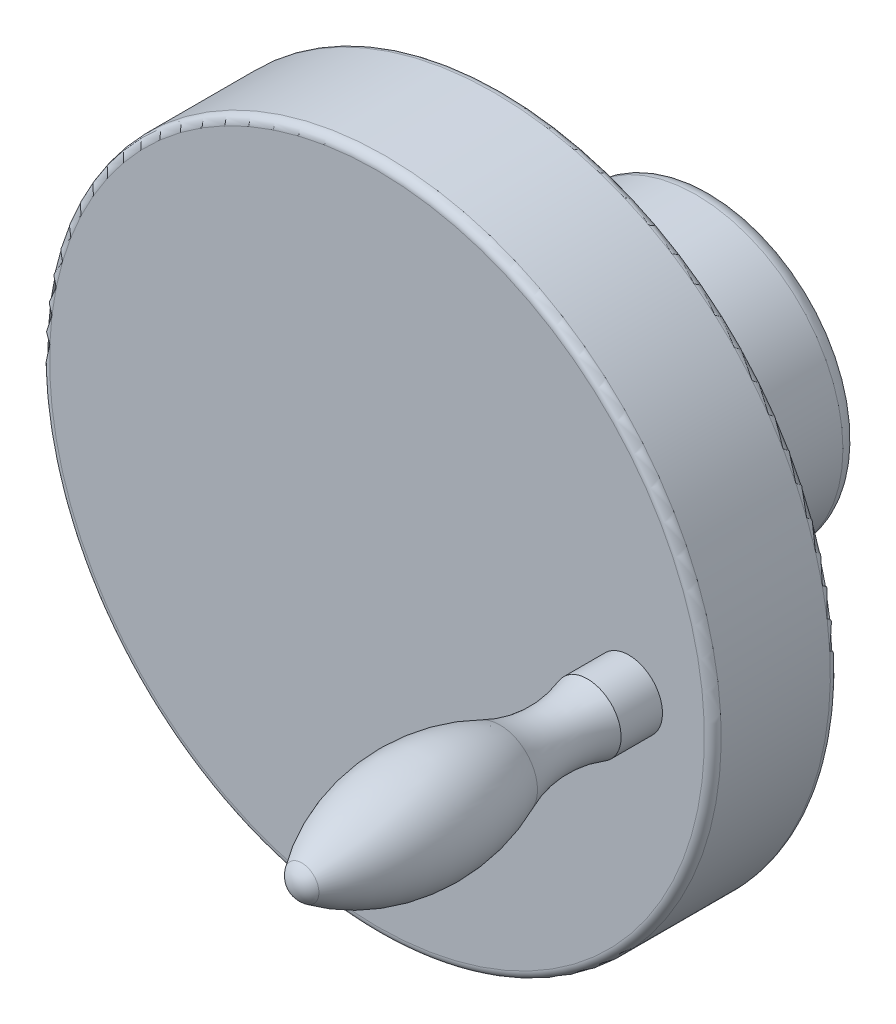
ISO-10303-21;
HEADER;
FILE_DESCRIPTION(('STEP AP214'),'2;1');
FILE_NAME('part.step','',(''),(''),'','','');
FILE_SCHEMA(('AUTOMOTIVE_DESIGN { 1 0 10303 214 1 1 1 1 }'));
ENDSEC;
DATA;
#1=APPLICATION_CONTEXT('core data for automotive mechanical design processes');
#2=APPLICATION_PROTOCOL_DEFINITION('international standard','automotive_design',2000,#1);
#3=PRODUCT_CONTEXT('',#1,'mechanical');
#4=PRODUCT('Part','Part','',(#3));
#5=PRODUCT_RELATED_PRODUCT_CATEGORY('part','',(#4));
#6=PRODUCT_DEFINITION_FORMATION('','',#4);
#7=PRODUCT_DEFINITION_CONTEXT('part definition',#1,'design');
#8=PRODUCT_DEFINITION('design','',#6,#7);
#9=PRODUCT_DEFINITION_SHAPE('','',#8);
#10=(LENGTH_UNIT() NAMED_UNIT(*) SI_UNIT(.MILLI.,.METRE.));
#11=(NAMED_UNIT(*) PLANE_ANGLE_UNIT() SI_UNIT($,.RADIAN.));
#12=(NAMED_UNIT(*) SI_UNIT($,.STERADIAN.) SOLID_ANGLE_UNIT());
#13=UNCERTAINTY_MEASURE_WITH_UNIT(LENGTH_MEASURE(1.E-05),#10,'distance_accuracy_value','');
#14=(GEOMETRIC_REPRESENTATION_CONTEXT(3) GLOBAL_UNCERTAINTY_ASSIGNED_CONTEXT((#13)) GLOBAL_UNIT_ASSIGNED_CONTEXT((#10,
#11,#12)) REPRESENTATION_CONTEXT('',''));
#15=CARTESIAN_POINT('',(0.,0.,0.));
#16=DIRECTION('',(0.,0.,1.));
#17=DIRECTION('',(1.,0.,0.));
#18=AXIS2_PLACEMENT_3D('',#15,#16,#17);
#19=CARTESIAN_POINT('',(0.,0.,40.));
#20=DIRECTION('',(0.,0.,1.));
#21=DIRECTION('',(0.,1.,0.));
#22=AXIS2_PLACEMENT_3D('',#19,#20,#21);
#23=PLANE('',#22);
#24=CARTESIAN_POINT('',(30.,0.,40.));
#25=DIRECTION('',(0.,0.,1.));
#26=DIRECTION('',(0.,1.,0.));
#27=AXIS2_PLACEMENT_3D('',#24,#25,#26);
#28=CIRCLE('',#27,4.00067893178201);
#29=CARTESIAN_POINT('',(30.,4.00067893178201,40.));
#30=VERTEX_POINT('',#29);
#31=EDGE_CURVE('E8',#30,#30,#28,.T.);
#32=ORIENTED_EDGE('',*,*,#31,.F.);
#33=EDGE_LOOP('',(#32));
#34=FACE_BOUND('',#33,.T.);
#35=CARTESIAN_POINT('',(0.,0.,40.));
#36=DIRECTION('',(0.,0.,1.));
#37=DIRECTION('',(0.,1.,0.));
#38=AXIS2_PLACEMENT_3D('',#35,#36,#37);
#39=CIRCLE('',#38,39.);
#40=CARTESIAN_POINT('',(0.,39.,40.));
#41=VERTEX_POINT('',#40);
#42=EDGE_CURVE('E18',#41,#41,#39,.T.);
#43=ORIENTED_EDGE('',*,*,#42,.T.);
#44=EDGE_LOOP('',(#43));
#45=FACE_BOUND('',#44,.T.);
#46=ADVANCED_FACE('F12',(#34,#45),#23,.T.);
#47=CARTESIAN_POINT('',(0.,0.,39.));
#48=DIRECTION('',(0.,0.,1.));
#49=DIRECTION('',(0.,1.,0.));
#50=AXIS2_PLACEMENT_3D('',#47,#48,#49);
#51=TOROIDAL_SURFACE('',#50,39.,1.);
#52=CARTESIAN_POINT('',(0.,0.,39.));
#53=DIRECTION('',(0.,0.,1.));
#54=DIRECTION('',(0.,1.,0.));
#55=AXIS2_PLACEMENT_3D('',#52,#53,#54);
#56=CIRCLE('',#55,40.);
#57=CARTESIAN_POINT('',(0.,40.,39.));
#58=VERTEX_POINT('',#57);
#59=EDGE_CURVE('E22',#58,#58,#56,.T.);
#60=ORIENTED_EDGE('',*,*,#59,.T.);
#61=EDGE_LOOP('',(#60));
#62=FACE_BOUND('',#61,.T.);
#63=ORIENTED_EDGE('',*,*,#42,.F.);
#64=EDGE_LOOP('',(#63));
#65=FACE_BOUND('',#64,.T.);
#66=ADVANCED_FACE('F83',(#62,#65),#51,.T.);
#67=CARTESIAN_POINT('',(0.,0.,45.));
#68=DIRECTION('',(0.,0.,1.));
#69=DIRECTION('',(0.,1.,0.));
#70=AXIS2_PLACEMENT_3D('',#67,#68,#69);
#71=CYLINDRICAL_SURFACE('',#70,40.);
#72=CARTESIAN_POINT('',(0.,0.,26.));
#73=DIRECTION('',(0.,0.,1.));
#74=DIRECTION('',(0.,1.,0.));
#75=AXIS2_PLACEMENT_3D('',#72,#73,#74);
#76=CIRCLE('',#75,40.);
#77=CARTESIAN_POINT('',(0.,40.,26.));
#78=VERTEX_POINT('',#77);
#79=EDGE_CURVE('E26',#78,#78,#76,.T.);
#80=ORIENTED_EDGE('',*,*,#79,.T.);
#81=EDGE_LOOP('',(#80));
#82=FACE_BOUND('',#81,.T.);
#83=ORIENTED_EDGE('',*,*,#59,.F.);
#84=EDGE_LOOP('',(#83));
#85=FACE_BOUND('',#84,.T.);
#86=ADVANCED_FACE('F88',(#82,#85),#71,.T.);
#87=CARTESIAN_POINT('',(0.,0.,26.));
#88=DIRECTION('',(0.,0.,1.));
#89=DIRECTION('',(0.,1.,0.));
#90=AXIS2_PLACEMENT_3D('',#87,#88,#89);
#91=TOROIDAL_SURFACE('',#90,39.,1.);
#92=CARTESIAN_POINT('',(0.,0.,25.));
#93=DIRECTION('',(0.,0.,1.));
#94=DIRECTION('',(0.,1.,0.));
#95=AXIS2_PLACEMENT_3D('',#92,#93,#94);
#96=CIRCLE('',#95,39.);
#97=CARTESIAN_POINT('',(0.,39.,25.));
#98=VERTEX_POINT('',#97);
#99=EDGE_CURVE('E31',#98,#98,#96,.T.);
#100=ORIENTED_EDGE('',*,*,#99,.T.);
#101=EDGE_LOOP('',(#100));
#102=FACE_BOUND('',#101,.T.);
#103=ORIENTED_EDGE('',*,*,#79,.F.);
#104=EDGE_LOOP('',(#103));
#105=FACE_BOUND('',#104,.T.);
#106=ADVANCED_FACE('F93',(#102,#105),#91,.T.);
#107=CARTESIAN_POINT('',(20.5,0.,25.));
#108=DIRECTION('',(0.,0.,1.));
#109=DIRECTION('',(0.,1.,0.));
#110=AXIS2_PLACEMENT_3D('',#107,#108,#109);
#111=PLANE('',#110);
#112=ORIENTED_EDGE('',*,*,#99,.F.);
#113=EDGE_LOOP('',(#112));
#114=FACE_BOUND('',#113,.T.);
#115=CARTESIAN_POINT('',(0.,0.,25.));
#116=DIRECTION('',(0.,0.,1.));
#117=DIRECTION('',(0.,1.,0.));
#118=AXIS2_PLACEMENT_3D('',#115,#116,#117);
#119=CIRCLE('',#118,20.5);
#120=CARTESIAN_POINT('',(0.,20.5,25.));
#121=VERTEX_POINT('',#120);
#122=EDGE_CURVE('E34',#121,#121,#119,.T.);
#123=ORIENTED_EDGE('',*,*,#122,.T.);
#124=EDGE_LOOP('',(#123));
#125=FACE_BOUND('',#124,.T.);
#126=ADVANCED_FACE('F100',(#114,#125),#111,.F.);
#127=CARTESIAN_POINT('',(0.,0.,22.));
#128=DIRECTION('',(0.,0.,1.));
#129=DIRECTION('',(0.,1.,0.));
#130=AXIS2_PLACEMENT_3D('',#127,#128,#129);
#131=TOROIDAL_SURFACE('',#130,20.5,3.);
#132=ORIENTED_EDGE('',*,*,#122,.F.);
#133=EDGE_LOOP('',(#132));
#134=FACE_BOUND('',#133,.T.);
#135=CARTESIAN_POINT('',(0.,0.,22.));
#136=DIRECTION('',(0.,0.,1.));
#137=DIRECTION('',(0.,1.,0.));
#138=AXIS2_PLACEMENT_3D('',#135,#136,#137);
#139=CIRCLE('',#138,17.5);
#140=CARTESIAN_POINT('',(0.,17.5,22.));
#141=VERTEX_POINT('',#140);
#142=EDGE_CURVE('E37',#141,#141,#139,.T.);
#143=ORIENTED_EDGE('',*,*,#142,.T.);
#144=EDGE_LOOP('',(#143));
#145=FACE_BOUND('',#144,.T.);
#146=ADVANCED_FACE('F104',(#134,#145),#131,.F.);
#147=CARTESIAN_POINT('',(0.,0.,45.));
#148=DIRECTION('',(0.,0.,1.));
#149=DIRECTION('',(0.,1.,0.));
#150=AXIS2_PLACEMENT_3D('',#147,#148,#149);
#151=CYLINDRICAL_SURFACE('',#150,17.5);
#152=CARTESIAN_POINT('',(0.,0.,2.));
#153=DIRECTION('',(0.,0.,1.));
#154=DIRECTION('',(0.,1.,0.));
#155=AXIS2_PLACEMENT_3D('',#152,#153,#154);
#156=CIRCLE('',#155,17.5);
#157=CARTESIAN_POINT('',(0.,17.5,2.));
#158=VERTEX_POINT('',#157);
#159=EDGE_CURVE('E40',#158,#158,#156,.T.);
#160=ORIENTED_EDGE('',*,*,#159,.T.);
#161=EDGE_LOOP('',(#160));
#162=FACE_BOUND('',#161,.T.);
#163=ORIENTED_EDGE('',*,*,#142,.F.);
#164=EDGE_LOOP('',(#163));
#165=FACE_BOUND('',#164,.T.);
#166=ADVANCED_FACE('F108',(#162,#165),#151,.T.);
#167=CARTESIAN_POINT('',(0.,0.,2.));
#168=DIRECTION('',(0.,0.,1.));
#169=DIRECTION('',(0.,1.,0.));
#170=AXIS2_PLACEMENT_3D('',#167,#168,#169);
#171=TOROIDAL_SURFACE('',#170,15.5,2.);
#172=CARTESIAN_POINT('',(0.,0.,0.));
#173=DIRECTION('',(0.,0.,1.));
#174=DIRECTION('',(0.,1.,0.));
#175=AXIS2_PLACEMENT_3D('',#172,#173,#174);
#176=CIRCLE('',#175,15.5);
#177=CARTESIAN_POINT('',(0.,15.5,0.));
#178=VERTEX_POINT('',#177);
#179=EDGE_CURVE('E43',#178,#178,#176,.T.);
#180=ORIENTED_EDGE('',*,*,#179,.T.);
#181=EDGE_LOOP('',(#180));
#182=FACE_BOUND('',#181,.T.);
#183=ORIENTED_EDGE('',*,*,#159,.F.);
#184=EDGE_LOOP('',(#183));
#185=FACE_BOUND('',#184,.T.);
#186=ADVANCED_FACE('F78',(#182,#185),#171,.T.);
#187=CARTESIAN_POINT('',(2.5,0.,0.));
#188=DIRECTION('',(0.,0.,1.));
#189=DIRECTION('',(0.,1.,0.));
#190=AXIS2_PLACEMENT_3D('',#187,#188,#189);
#191=PLANE('',#190);
#192=ORIENTED_EDGE('',*,*,#179,.F.);
#193=EDGE_LOOP('',(#192));
#194=FACE_BOUND('',#193,.T.);
#195=CARTESIAN_POINT('',(0.,0.,0.));
#196=DIRECTION('',(0.,0.,1.));
#197=DIRECTION('',(0.,1.,0.));
#198=AXIS2_PLACEMENT_3D('',#195,#196,#197);
#199=CIRCLE('',#198,2.5);
#200=CARTESIAN_POINT('',(0.,2.5,0.));
#201=VERTEX_POINT('',#200);
#202=EDGE_CURVE('E46',#201,#201,#199,.T.);
#203=ORIENTED_EDGE('',*,*,#202,.T.);
#204=EDGE_LOOP('',(#203));
#205=FACE_BOUND('',#204,.T.);
#206=ADVANCED_FACE('F67',(#194,#205),#191,.F.);
#207=CARTESIAN_POINT('',(0.,0.,45.));
#208=DIRECTION('',(0.,0.,1.));
#209=DIRECTION('',(0.,1.,0.));
#210=AXIS2_PLACEMENT_3D('',#207,#208,#209);
#211=CYLINDRICAL_SURFACE('',#210,2.5);
#212=ORIENTED_EDGE('',*,*,#202,.F.);
#213=EDGE_LOOP('',(#212));
#214=FACE_BOUND('',#213,.T.);
#215=CARTESIAN_POINT('',(0.,0.,15.));
#216=DIRECTION('',(0.,0.,-1.));
#217=DIRECTION('',(0.,1.,0.));
#218=AXIS2_PLACEMENT_3D('',#215,#216,#217);
#219=CIRCLE('',#218,2.5);
#220=CARTESIAN_POINT('',(0.,2.5,15.));
#221=VERTEX_POINT('',#220);
#222=EDGE_CURVE('E58',#221,#221,#219,.T.);
#223=ORIENTED_EDGE('',*,*,#222,.F.);
#224=EDGE_LOOP('',(#223));
#225=FACE_BOUND('',#224,.T.);
#226=ADVANCED_FACE('F64',(#214,#225),#211,.F.);
#227=CARTESIAN_POINT('',(30.,0.,49.529705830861));
#228=DIRECTION('',(0.,0.,1.));
#229=DIRECTION('',(0.,1.,0.));
#230=AXIS2_PLACEMENT_3D('',#227,#228,#229);
#231=TOROIDAL_SURFACE('',#230,17.7506789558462,14.4999999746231);
#232=CARTESIAN_POINT('',(30.,0.,55.3599479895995));
#233=DIRECTION('',(0.,0.,1.));
#234=DIRECTION('',(0.,1.,0.));
#235=AXIS2_PLACEMENT_3D('',#232,#233,#234);
#236=CIRCLE('',#235,4.47444923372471);
#237=CARTESIAN_POINT('',(30.,4.47444923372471,55.3599479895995));
#238=VERTEX_POINT('',#237);
#239=EDGE_CURVE('E55',#238,#238,#236,.T.);
#240=ORIENTED_EDGE('',*,*,#239,.F.);
#241=EDGE_LOOP('',(#240));
#242=FACE_BOUND('',#241,.T.);
#243=CARTESIAN_POINT('',(30.,0.,44.9267178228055));
#244=DIRECTION('',(0.,0.,1.));
#245=DIRECTION('',(0.,1.,0.));
#246=AXIS2_PLACEMENT_3D('',#243,#244,#245);
#247=CIRCLE('',#246,4.00067893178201);
#248=CARTESIAN_POINT('',(30.,4.00067893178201,44.9267178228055));
#249=VERTEX_POINT('',#248);
#250=EDGE_CURVE('E49',#249,#249,#247,.T.);
#251=ORIENTED_EDGE('',*,*,#250,.T.);
#252=EDGE_LOOP('',(#251));
#253=FACE_BOUND('',#252,.T.);
#254=ADVANCED_FACE('F66',(#242,#253),#231,.F.);
#255=CARTESIAN_POINT('',(30.,0.,85.));
#256=DIRECTION('',(0.,0.,1.));
#257=DIRECTION('',(0.,1.,0.));
#258=AXIS2_PLACEMENT_3D('',#255,#256,#257);
#259=CYLINDRICAL_SURFACE('',#258,4.00067893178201);
#260=ORIENTED_EDGE('',*,*,#31,.T.);
#261=EDGE_LOOP('',(#260));
#262=FACE_BOUND('',#261,.T.);
#263=ORIENTED_EDGE('',*,*,#250,.F.);
#264=EDGE_LOOP('',(#263));
#265=FACE_BOUND('',#264,.T.);
#266=ADVANCED_FACE('F75',(#262,#265),#259,.T.);
#267=CARTESIAN_POINT('',(30.,0.,77.5));
#268=DIRECTION('',(0.,1.,0.));
#269=DIRECTION('',(0.,0.,-1.));
#270=AXIS2_PLACEMENT_3D('',#267,#268,#269);
#271=SPHERICAL_SURFACE('',#270,2.49999999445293);
#272=CARTESIAN_POINT('',(30.,0.,77.5));
#273=DIRECTION('',(0.,0.,1.));
#274=DIRECTION('',(0.,1.,0.));
#275=AXIS2_PLACEMENT_3D('',#272,#273,#274);
#276=SPHERICAL_SURFACE('',#275,2.49999999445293);
#277=CARTESIAN_POINT('',(30.,0.,78.95232511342));
#278=DIRECTION('',(0.,0.,1.));
#279=DIRECTION('',(0.,1.,0.));
#280=AXIS2_PLACEMENT_3D('',#277,#278,#279);
#281=CIRCLE('',#280,2.03488371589);
#282=CARTESIAN_POINT('',(30.,2.03488371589,78.95232511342));
#283=VERTEX_POINT('',#282);
#284=EDGE_CURVE('E52',#283,#283,#281,.T.);
#285=ORIENTED_EDGE('',*,*,#284,.T.);
#286=EDGE_LOOP('',(#285));
#287=FACE_BOUND('',#286,.T.);
#288=ADVANCED_FACE('F154',(#287),#276,.T.);
#289=CARTESIAN_POINT('',(30.,0.,65.010003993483));
#290=DIRECTION('',(0.,0.,1.));
#291=DIRECTION('',(0.,1.,0.));
#292=AXIS2_PLACEMENT_3D('',#289,#290,#291);
#293=DEGENERATE_TOROIDAL_SURFACE('',#292,17.5000000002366,24.0000000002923,.F.);
#294=ORIENTED_EDGE('',*,*,#239,.T.);
#295=EDGE_LOOP('',(#294));
#296=FACE_BOUND('',#295,.T.);
#297=ORIENTED_EDGE('',*,*,#284,.F.);
#298=EDGE_LOOP('',(#297));
#299=FACE_BOUND('',#298,.T.);
#300=ADVANCED_FACE('F163',(#296,#299),#293,.F.);
#301=CARTESIAN_POINT('',(0.,0.,15.));
#302=DIRECTION('',(0.,0.,-1.));
#303=DIRECTION('',(0.,1.,0.));
#304=AXIS2_PLACEMENT_3D('',#301,#302,#303);
#305=PLANE('',#304);
#306=ORIENTED_EDGE('',*,*,#222,.T.);
#307=EDGE_LOOP('',(#306));
#308=FACE_BOUND('',#307,.T.);
#309=ADVANCED_FACE('F62',(#308),#305,.T.);
#310=CLOSED_SHELL('',(#46,#66,#86,#106,#126,#146,#166,#186,#206,#226,#254,#266,#288,#300,#309));
#311=MANIFOLD_SOLID_BREP('B1',#310);
#312=ADVANCED_BREP_SHAPE_REPRESENTATION('',(#18,#311),#14);
#313=SHAPE_DEFINITION_REPRESENTATION(#9,#312);
ENDSEC;
END-ISO-10303-21;
